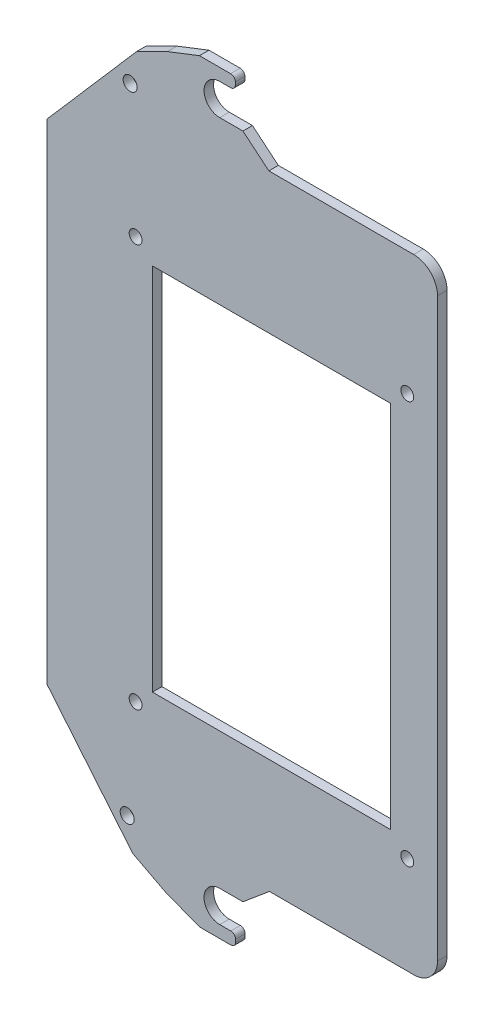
ISO-10303-21;
HEADER;
FILE_DESCRIPTION(('STEP AP214'),'2;1');
FILE_NAME('part.step','',(''),(''),'','','');
FILE_SCHEMA(('AUTOMOTIVE_DESIGN { 1 0 10303 214 1 1 1 1 }'));
ENDSEC;
DATA;
#1=APPLICATION_CONTEXT('core data for automotive mechanical design processes');
#2=APPLICATION_PROTOCOL_DEFINITION('international standard','automotive_design',2000,#1);
#3=PRODUCT_CONTEXT('',#1,'mechanical');
#4=PRODUCT('Part','Part','',(#3));
#5=PRODUCT_RELATED_PRODUCT_CATEGORY('part','',(#4));
#6=PRODUCT_DEFINITION_FORMATION('','',#4);
#7=PRODUCT_DEFINITION_CONTEXT('part definition',#1,'design');
#8=PRODUCT_DEFINITION('design','',#6,#7);
#9=PRODUCT_DEFINITION_SHAPE('','',#8);
#10=(LENGTH_UNIT() NAMED_UNIT(*) SI_UNIT(.MILLI.,.METRE.));
#11=(NAMED_UNIT(*) PLANE_ANGLE_UNIT() SI_UNIT($,.RADIAN.));
#12=(NAMED_UNIT(*) SI_UNIT($,.STERADIAN.) SOLID_ANGLE_UNIT());
#13=UNCERTAINTY_MEASURE_WITH_UNIT(LENGTH_MEASURE(1.E-05),#10,'distance_accuracy_value','');
#14=(GEOMETRIC_REPRESENTATION_CONTEXT(3) GLOBAL_UNCERTAINTY_ASSIGNED_CONTEXT((#13)) GLOBAL_UNIT_ASSIGNED_CONTEXT((#10,
#11,#12)) REPRESENTATION_CONTEXT('',''));
#15=CARTESIAN_POINT('',(0.,0.,0.));
#16=DIRECTION('',(0.,0.,1.));
#17=DIRECTION('',(1.,0.,0.));
#18=AXIS2_PLACEMENT_3D('',#15,#16,#17);
#19=CARTESIAN_POINT('',(10874.1660554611,3506.25153713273,2.032));
#20=DIRECTION('',(0.,0.,1.));
#21=DIRECTION('',(1.,0.,0.));
#22=AXIS2_PLACEMENT_3D('',#19,#20,#21);
#23=CYLINDRICAL_SURFACE('',#22,1.016);
#24=DIRECTION('',(0.,0.,1.));
#25=VECTOR('',#24,1.);
#26=CARTESIAN_POINT('',(10875.1820554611,3506.25153713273,2.032));
#27=LINE('',#26,#25);
#28=CARTESIAN_POINT('',(10875.1820554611,3506.25153713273,0.));
#29=VERTEX_POINT('',#28);
#30=CARTESIAN_POINT('',(10875.1820554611,3506.25153713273,2.032));
#31=VERTEX_POINT('',#30);
#32=EDGE_CURVE('E649',#29,#31,#27,.T.);
#33=ORIENTED_EDGE('',*,*,#32,.F.);
#34=CARTESIAN_POINT('',(10874.1660554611,3506.25153713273,0.));
#35=DIRECTION('',(0.,0.,1.));
#36=DIRECTION('',(1.,0.,0.));
#37=AXIS2_PLACEMENT_3D('',#34,#35,#36);
#38=CIRCLE('',#37,1.016);
#39=CARTESIAN_POINT('',(10874.1660554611,3507.26753713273,0.));
#40=VERTEX_POINT('',#39);
#41=EDGE_CURVE('E62',#40,#29,#38,.F.);
#42=ORIENTED_EDGE('',*,*,#41,.F.);
#43=DIRECTION('',(0.,0.,1.));
#44=VECTOR('',#43,1.);
#45=CARTESIAN_POINT('',(10874.1660554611,3507.26753713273,2.032));
#46=LINE('',#45,#44);
#47=CARTESIAN_POINT('',(10874.1660554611,3507.26753713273,2.032));
#48=VERTEX_POINT('',#47);
#49=EDGE_CURVE('E653',#48,#40,#46,.F.);
#50=ORIENTED_EDGE('',*,*,#49,.F.);
#51=CARTESIAN_POINT('',(10874.1660554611,3506.25153713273,2.032));
#52=DIRECTION('',(0.,0.,1.));
#53=DIRECTION('',(1.,0.,0.));
#54=AXIS2_PLACEMENT_3D('',#51,#52,#53);
#55=CIRCLE('',#54,1.016);
#56=EDGE_CURVE('E13',#31,#48,#55,.T.);
#57=ORIENTED_EDGE('',*,*,#56,.F.);
#58=EDGE_LOOP('',(#33,#42,#50,#57));
#59=FACE_BOUND('',#58,.T.);
#60=ADVANCED_FACE('F54',(#59),#23,.T.);
#61=CARTESIAN_POINT('',(10874.1660554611,3505.68485709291,2.032));
#62=DIRECTION('',(0.,0.,1.));
#63=DIRECTION('',(1.,0.,0.));
#64=AXIS2_PLACEMENT_3D('',#61,#62,#63);
#65=CYLINDRICAL_SURFACE('',#64,1.016);
#66=DIRECTION('',(0.,0.,1.));
#67=VECTOR('',#66,1.);
#68=CARTESIAN_POINT('',(10874.1660554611,3504.66885709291,2.032));
#69=LINE('',#68,#67);
#70=CARTESIAN_POINT('',(10874.1660554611,3504.66885709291,0.));
#71=VERTEX_POINT('',#70);
#72=CARTESIAN_POINT('',(10874.1660554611,3504.66885709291,2.032));
#73=VERTEX_POINT('',#72);
#74=EDGE_CURVE('E635',#71,#73,#69,.T.);
#75=ORIENTED_EDGE('',*,*,#74,.F.);
#76=CARTESIAN_POINT('',(10874.1660554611,3505.68485709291,0.));
#77=DIRECTION('',(0.,0.,1.));
#78=DIRECTION('',(1.,0.,0.));
#79=AXIS2_PLACEMENT_3D('',#76,#77,#78);
#80=CIRCLE('',#79,1.016);
#81=CARTESIAN_POINT('',(10875.1820554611,3505.68485709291,0.));
#82=VERTEX_POINT('',#81);
#83=EDGE_CURVE('E643',#82,#71,#80,.F.);
#84=ORIENTED_EDGE('',*,*,#83,.F.);
#85=DIRECTION('',(0.,0.,1.));
#86=VECTOR('',#85,1.);
#87=CARTESIAN_POINT('',(10875.1820554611,3505.68485709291,2.032));
#88=LINE('',#87,#86);
#89=CARTESIAN_POINT('',(10875.1820554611,3505.68485709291,2.032));
#90=VERTEX_POINT('',#89);
#91=EDGE_CURVE('E639',#90,#82,#88,.F.);
#92=ORIENTED_EDGE('',*,*,#91,.F.);
#93=CARTESIAN_POINT('',(10874.1660554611,3505.68485709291,2.032));
#94=DIRECTION('',(0.,0.,1.));
#95=DIRECTION('',(1.,0.,0.));
#96=AXIS2_PLACEMENT_3D('',#93,#94,#95);
#97=CIRCLE('',#96,1.016);
#98=EDGE_CURVE('E646',#73,#90,#97,.T.);
#99=ORIENTED_EDGE('',*,*,#98,.F.);
#100=EDGE_LOOP('',(#75,#84,#92,#99));
#101=FACE_BOUND('',#100,.T.);
#102=ADVANCED_FACE('F667',(#101),#65,.T.);
#103=CARTESIAN_POINT('',(10874.2239121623,3347.74734528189,2.032));
#104=DIRECTION('',(0.,0.,1.));
#105=DIRECTION('',(1.,0.,0.));
#106=AXIS2_PLACEMENT_3D('',#103,#104,#105);
#107=CYLINDRICAL_SURFACE('',#106,1.016);
#108=DIRECTION('',(0.,0.,1.));
#109=VECTOR('',#108,1.);
#110=CARTESIAN_POINT('',(10875.2399121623,3347.74734528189,2.032));
#111=LINE('',#110,#109);
#112=CARTESIAN_POINT('',(10875.2399121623,3347.74734528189,0.));
#113=VERTEX_POINT('',#112);
#114=CARTESIAN_POINT('',(10875.2399121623,3347.74734528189,2.032));
#115=VERTEX_POINT('',#114);
#116=EDGE_CURVE('E621',#113,#115,#111,.T.);
#117=ORIENTED_EDGE('',*,*,#116,.F.);
#118=CARTESIAN_POINT('',(10874.2239121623,3347.74734528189,0.));
#119=DIRECTION('',(0.,0.,1.));
#120=DIRECTION('',(1.,0.,0.));
#121=AXIS2_PLACEMENT_3D('',#118,#119,#120);
#122=CIRCLE('',#121,1.016);
#123=CARTESIAN_POINT('',(10874.2239121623,3348.76334528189,0.));
#124=VERTEX_POINT('',#123);
#125=EDGE_CURVE('E629',#124,#113,#122,.F.);
#126=ORIENTED_EDGE('',*,*,#125,.F.);
#127=DIRECTION('',(0.,0.,1.));
#128=VECTOR('',#127,1.);
#129=CARTESIAN_POINT('',(10874.2239121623,3348.76334528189,2.032));
#130=LINE('',#129,#128);
#131=CARTESIAN_POINT('',(10874.2239121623,3348.76334528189,2.032));
#132=VERTEX_POINT('',#131);
#133=EDGE_CURVE('E625',#132,#124,#130,.F.);
#134=ORIENTED_EDGE('',*,*,#133,.F.);
#135=CARTESIAN_POINT('',(10874.2239121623,3347.74734528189,2.032));
#136=DIRECTION('',(0.,0.,1.));
#137=DIRECTION('',(1.,0.,0.));
#138=AXIS2_PLACEMENT_3D('',#135,#136,#137);
#139=CIRCLE('',#138,1.016);
#140=EDGE_CURVE('E632',#115,#132,#139,.T.);
#141=ORIENTED_EDGE('',*,*,#140,.F.);
#142=EDGE_LOOP('',(#117,#126,#134,#141));
#143=FACE_BOUND('',#142,.T.);
#144=ADVANCED_FACE('F731',(#143),#107,.T.);
#145=CARTESIAN_POINT('',(10874.2239121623,3347.18092181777,2.032));
#146=DIRECTION('',(0.,0.,-1.));
#147=DIRECTION('',(-1.,0.,0.));
#148=AXIS2_PLACEMENT_3D('',#145,#146,#147);
#149=CYLINDRICAL_SURFACE('',#148,1.016);
#150=DIRECTION('',(0.,0.,-1.));
#151=VECTOR('',#150,1.);
#152=CARTESIAN_POINT('',(10875.2399121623,3347.18092181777,2.032));
#153=LINE('',#152,#151);
#154=CARTESIAN_POINT('',(10875.2399121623,3347.18092181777,2.032));
#155=VERTEX_POINT('',#154);
#156=CARTESIAN_POINT('',(10875.2399121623,3347.18092181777,0.));
#157=VERTEX_POINT('',#156);
#158=EDGE_CURVE('E607',#155,#157,#153,.T.);
#159=ORIENTED_EDGE('',*,*,#158,.F.);
#160=CARTESIAN_POINT('',(10874.2239121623,3347.18092181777,2.032));
#161=DIRECTION('',(0.,0.,1.));
#162=DIRECTION('',(1.,0.,0.));
#163=AXIS2_PLACEMENT_3D('',#160,#161,#162);
#164=CIRCLE('',#163,1.016);
#165=CARTESIAN_POINT('',(10874.2239121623,3346.16492181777,2.032));
#166=VERTEX_POINT('',#165);
#167=EDGE_CURVE('E615',#166,#155,#164,.T.);
#168=ORIENTED_EDGE('',*,*,#167,.F.);
#169=DIRECTION('',(0.,0.,-1.));
#170=VECTOR('',#169,1.);
#171=CARTESIAN_POINT('',(10874.2239121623,3346.16492181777,2.032));
#172=LINE('',#171,#170);
#173=CARTESIAN_POINT('',(10874.2239121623,3346.16492181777,0.));
#174=VERTEX_POINT('',#173);
#175=EDGE_CURVE('E611',#174,#166,#172,.F.);
#176=ORIENTED_EDGE('',*,*,#175,.F.);
#177=CARTESIAN_POINT('',(10874.2239121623,3347.18092181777,0.));
#178=DIRECTION('',(0.,0.,1.));
#179=DIRECTION('',(1.,0.,0.));
#180=AXIS2_PLACEMENT_3D('',#177,#178,#179);
#181=CIRCLE('',#180,1.016);
#182=EDGE_CURVE('E618',#157,#174,#181,.F.);
#183=ORIENTED_EDGE('',*,*,#182,.F.);
#184=EDGE_LOOP('',(#159,#168,#176,#183));
#185=FACE_BOUND('',#184,.T.);
#186=ADVANCED_FACE('F740',(#185),#149,.T.);
#187=CARTESIAN_POINT('',(10913.2602505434,3365.2718064,2.032));
#188=DIRECTION('',(0.,0.,-1.));
#189=DIRECTION('',(-1.,0.,0.));
#190=AXIS2_PLACEMENT_3D('',#187,#188,#189);
#191=CYLINDRICAL_SURFACE('',#190,5.08);
#192=DIRECTION('',(0.,0.,-1.));
#193=VECTOR('',#192,1.);
#194=CARTESIAN_POINT('',(10918.3402505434,3365.2718064,2.032));
#195=LINE('',#194,#193);
#196=CARTESIAN_POINT('',(10918.3402505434,3365.2718064,2.032));
#197=VERTEX_POINT('',#196);
#198=CARTESIAN_POINT('',(10918.3402505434,3365.2718064,0.));
#199=VERTEX_POINT('',#198);
#200=EDGE_CURVE('E593',#197,#199,#195,.T.);
#201=ORIENTED_EDGE('',*,*,#200,.F.);
#202=CARTESIAN_POINT('',(10913.2602505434,3365.2718064,2.032));
#203=DIRECTION('',(0.,0.,1.));
#204=DIRECTION('',(1.,0.,0.));
#205=AXIS2_PLACEMENT_3D('',#202,#203,#204);
#206=CIRCLE('',#205,5.08);
#207=CARTESIAN_POINT('',(10913.2602505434,3360.1918064,2.032));
#208=VERTEX_POINT('',#207);
#209=EDGE_CURVE('E601',#208,#197,#206,.T.);
#210=ORIENTED_EDGE('',*,*,#209,.F.);
#211=DIRECTION('',(0.,0.,-1.));
#212=VECTOR('',#211,1.);
#213=CARTESIAN_POINT('',(10913.2602505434,3360.1918064,2.032));
#214=LINE('',#213,#212);
#215=CARTESIAN_POINT('',(10913.2602505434,3360.1918064,0.));
#216=VERTEX_POINT('',#215);
#217=EDGE_CURVE('E597',#216,#208,#214,.F.);
#218=ORIENTED_EDGE('',*,*,#217,.F.);
#219=CARTESIAN_POINT('',(10913.2602505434,3365.2718064,0.));
#220=DIRECTION('',(0.,0.,1.));
#221=DIRECTION('',(1.,0.,0.));
#222=AXIS2_PLACEMENT_3D('',#219,#220,#221);
#223=CIRCLE('',#222,5.08);
#224=EDGE_CURVE('E604',#199,#216,#223,.F.);
#225=ORIENTED_EDGE('',*,*,#224,.F.);
#226=EDGE_LOOP('',(#201,#210,#218,#225));
#227=FACE_BOUND('',#226,.T.);
#228=ADVANCED_FACE('F703',(#227),#191,.T.);
#229=CARTESIAN_POINT('',(10913.2602505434,3488.2934144,2.032));
#230=DIRECTION('',(0.,0.,-1.));
#231=DIRECTION('',(-1.,0.,0.));
#232=AXIS2_PLACEMENT_3D('',#229,#230,#231);
#233=CYLINDRICAL_SURFACE('',#232,5.08);
#234=DIRECTION('',(0.,0.,-1.));
#235=VECTOR('',#234,1.);
#236=CARTESIAN_POINT('',(10913.2602505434,3493.3734144,2.032));
#237=LINE('',#236,#235);
#238=CARTESIAN_POINT('',(10913.2602505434,3493.3734144,2.032));
#239=VERTEX_POINT('',#238);
#240=CARTESIAN_POINT('',(10913.2602505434,3493.3734144,0.));
#241=VERTEX_POINT('',#240);
#242=EDGE_CURVE('E578',#239,#241,#237,.T.);
#243=ORIENTED_EDGE('',*,*,#242,.F.);
#244=CARTESIAN_POINT('',(10913.2602505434,3488.2934144,2.032));
#245=DIRECTION('',(0.,0.,1.));
#246=DIRECTION('',(1.,0.,0.));
#247=AXIS2_PLACEMENT_3D('',#244,#245,#246);
#248=CIRCLE('',#247,5.08);
#249=CARTESIAN_POINT('',(10918.3402505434,3488.2934144,2.032));
#250=VERTEX_POINT('',#249);
#251=EDGE_CURVE('E586',#250,#239,#248,.T.);
#252=ORIENTED_EDGE('',*,*,#251,.F.);
#253=DIRECTION('',(0.,0.,-1.));
#254=VECTOR('',#253,1.);
#255=CARTESIAN_POINT('',(10918.3402505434,3488.2934144,2.032));
#256=LINE('',#255,#254);
#257=CARTESIAN_POINT('',(10918.3402505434,3488.2934144,0.));
#258=VERTEX_POINT('',#257);
#259=EDGE_CURVE('E582',#258,#250,#256,.F.);
#260=ORIENTED_EDGE('',*,*,#259,.F.);
#261=CARTESIAN_POINT('',(10913.2602505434,3488.2934144,0.));
#262=DIRECTION('',(0.,0.,1.));
#263=DIRECTION('',(1.,0.,0.));
#264=AXIS2_PLACEMENT_3D('',#261,#262,#263);
#265=CIRCLE('',#264,5.08);
#266=EDGE_CURVE('E589',#241,#258,#265,.F.);
#267=ORIENTED_EDGE('',*,*,#266,.F.);
#268=EDGE_LOOP('',(#243,#252,#260,#267));
#269=FACE_BOUND('',#268,.T.);
#270=ADVANCED_FACE('F693',(#269),#233,.T.);
#271=CARTESIAN_POINT('',(10871.8355987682,3352.1098019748,2.032));
#272=DIRECTION('',(0.,0.,1.));
#273=DIRECTION('',(1.,0.,0.));
#274=AXIS2_PLACEMENT_3D('',#271,#272,#273);
#275=PLANE('',#274);
#276=DIRECTION('',(0.,1.,0.));
#277=VECTOR('',#276,1.);
#278=CARTESIAN_POINT('',(10875.1820554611,3504.66885709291,2.032));
#279=LINE('',#278,#277);
#280=EDGE_CURVE('E380',#90,#31,#279,.T.);
#281=ORIENTED_EDGE('',*,*,#280,.T.);
#282=ORIENTED_EDGE('',*,*,#56,.T.);
#283=DIRECTION('',(-1.,0.,0.));
#284=VECTOR('',#283,1.);
#285=CARTESIAN_POINT('',(10875.1820554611,3507.26753713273,2.032));
#286=LINE('',#285,#284);
#287=CARTESIAN_POINT('',(10867.5110434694,3507.26753713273,2.032));
#288=VERTEX_POINT('',#287);
#289=EDGE_CURVE('E383',#48,#288,#286,.T.);
#290=ORIENTED_EDGE('',*,*,#289,.T.);
#291=DIRECTION('',(-0.931894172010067,-0.362730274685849,0.));
#292=VECTOR('',#291,1.);
#293=CARTESIAN_POINT('',(10860.6675284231,3504.60376889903,2.032));
#294=LINE('',#293,#292);
#295=CARTESIAN_POINT('',(10860.6675284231,3504.60376889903,2.032));
#296=VERTEX_POINT('',#295);
#297=EDGE_CURVE('E386',#288,#296,#294,.T.);
#298=ORIENTED_EDGE('',*,*,#297,.T.);
#299=DIRECTION('',(-0.895259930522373,-0.445544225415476,0.));
#300=VECTOR('',#299,1.);
#301=CARTESIAN_POINT('',(10854.1150434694,3501.34279213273,2.032));
#302=LINE('',#301,#300);
#303=CARTESIAN_POINT('',(10854.1150434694,3501.34279213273,2.032));
#304=VERTEX_POINT('',#303);
#305=EDGE_CURVE('E389',#296,#304,#302,.T.);
#306=ORIENTED_EDGE('',*,*,#305,.T.);
#307=DIRECTION('',(-0.777468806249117,-0.628921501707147,0.));
#308=VECTOR('',#307,1.);
#309=CARTESIAN_POINT('',(10854.1004934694,3501.33102213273,2.032));
#310=LINE('',#309,#308);
#311=CARTESIAN_POINT('',(10854.1004934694,3501.33102213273,2.032));
#312=VERTEX_POINT('',#311);
#313=EDGE_CURVE('E392',#304,#312,#310,.T.);
#314=ORIENTED_EDGE('',*,*,#313,.T.);
#315=DIRECTION('',(-0.65538942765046,-0.755291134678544,0.));
#316=VECTOR('',#315,1.);
#317=CARTESIAN_POINT('',(10854.1004934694,3501.33102213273,2.032));
#318=LINE('',#317,#316);
#319=CARTESIAN_POINT('',(10834.9529554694,3479.2648045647,2.032));
#320=VERTEX_POINT('',#319);
#321=EDGE_CURVE('E395',#312,#320,#318,.T.);
#322=ORIENTED_EDGE('',*,*,#321,.T.);
#323=DIRECTION('',(0.,-1.,0.));
#324=VECTOR('',#323,1.);
#325=CARTESIAN_POINT('',(10834.9529554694,3479.2648045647,2.032));
#326=LINE('',#325,#324);
#327=CARTESIAN_POINT('',(10834.9529554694,3374.75768053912,2.032));
#328=VERTEX_POINT('',#327);
#329=EDGE_CURVE('E398',#320,#328,#326,.T.);
#330=ORIENTED_EDGE('',*,*,#329,.T.);
#331=DIRECTION('',(0.637647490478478,-0.770328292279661,0.));
#332=VECTOR('',#331,1.);
#333=CARTESIAN_POINT('',(10834.9529554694,3374.75768053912,2.032));
#334=LINE('',#333,#332);
#335=CARTESIAN_POINT('',(10853.2782434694,3352.61929213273,2.032));
#336=VERTEX_POINT('',#335);
#337=EDGE_CURVE('E401',#328,#336,#334,.T.);
#338=ORIENTED_EDGE('',*,*,#337,.T.);
#339=DIRECTION('',(0.886464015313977,-0.462797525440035,0.));
#340=VECTOR('',#339,1.);
#341=CARTESIAN_POINT('',(10860.222293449,3348.99400211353,2.032));
#342=LINE('',#341,#340);
#343=CARTESIAN_POINT('',(10860.222293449,3348.99400211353,2.032));
#344=VERTEX_POINT('',#343);
#345=EDGE_CURVE('E404',#336,#344,#342,.T.);
#346=ORIENTED_EDGE('',*,*,#345,.T.);
#347=DIRECTION('',(0.932239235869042,-0.361842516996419,0.));
#348=VECTOR('',#347,1.);
#349=CARTESIAN_POINT('',(10867.5110434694,3346.16492181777,2.032));
#350=LINE('',#349,#348);
#351=CARTESIAN_POINT('',(10867.5110434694,3346.16492181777,2.032));
#352=VERTEX_POINT('',#351);
#353=EDGE_CURVE('E407',#344,#352,#350,.T.);
#354=ORIENTED_EDGE('',*,*,#353,.T.);
#355=DIRECTION('',(1.,0.,0.));
#356=VECTOR('',#355,1.);
#357=CARTESIAN_POINT('',(10875.2399121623,3346.16492181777,2.032));
#358=LINE('',#357,#356);
#359=EDGE_CURVE('E410',#352,#166,#358,.T.);
#360=ORIENTED_EDGE('',*,*,#359,.T.);
#361=ORIENTED_EDGE('',*,*,#167,.T.);
#362=DIRECTION('',(0.,1.,0.));
#363=VECTOR('',#362,1.);
#364=CARTESIAN_POINT('',(10875.2399121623,3348.76334528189,2.032));
#365=LINE('',#364,#363);
#366=EDGE_CURVE('E414',#155,#115,#365,.T.);
#367=ORIENTED_EDGE('',*,*,#366,.T.);
#368=ORIENTED_EDGE('',*,*,#140,.T.);
#369=DIRECTION('',(-1.,1.30448979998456E-13,0.));
#370=VECTOR('',#369,1.);
#371=CARTESIAN_POINT('',(10871.8355987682,3348.76334528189,2.032));
#372=LINE('',#371,#370);
#373=CARTESIAN_POINT('',(10871.8355987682,3348.76334528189,2.032));
#374=VERTEX_POINT('',#373);
#375=EDGE_CURVE('E418',#132,#374,#372,.T.);
#376=ORIENTED_EDGE('',*,*,#375,.T.);
#377=CARTESIAN_POINT('',(10871.8355987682,3352.1098019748,2.032));
#378=DIRECTION('',(0.,0.,-1.));
#379=DIRECTION('',(1.,0.,0.));
#380=AXIS2_PLACEMENT_3D('',#377,#378,#379);
#381=CIRCLE('',#380,3.34645669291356);
#382=CARTESIAN_POINT('',(10871.8355987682,3355.45625866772,2.032));
#383=VERTEX_POINT('',#382);
#384=EDGE_CURVE('E421',#374,#383,#381,.T.);
#385=ORIENTED_EDGE('',*,*,#384,.T.);
#386=DIRECTION('',(0.99999965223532,0.000833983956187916,0.));
#387=VECTOR('',#386,1.);
#388=CARTESIAN_POINT('',(10871.8355987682,3355.45625866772,2.032));
#389=LINE('',#388,#387);
#390=CARTESIAN_POINT('',(10876.7976307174,3355.46039692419,2.032));
#391=VERTEX_POINT('',#390);
#392=EDGE_CURVE('E424',#383,#391,#389,.T.);
#393=ORIENTED_EDGE('',*,*,#392,.T.);
#394=DIRECTION('',(0.767146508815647,0.641471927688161,0.));
#395=VECTOR('',#394,1.);
#396=CARTESIAN_POINT('',(10876.7976307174,3355.46039692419,2.032));
#397=LINE('',#396,#395);
#398=CARTESIAN_POINT('',(10882.4559987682,3360.1918064,2.032));
#399=VERTEX_POINT('',#398);
#400=EDGE_CURVE('E427',#391,#399,#397,.T.);
#401=ORIENTED_EDGE('',*,*,#400,.T.);
#402=DIRECTION('',(1.,0.,0.));
#403=VECTOR('',#402,1.);
#404=CARTESIAN_POINT('',(10882.4559987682,3360.1918064,2.032));
#405=LINE('',#404,#403);
#406=EDGE_CURVE('E430',#399,#208,#405,.T.);
#407=ORIENTED_EDGE('',*,*,#406,.T.);
#408=ORIENTED_EDGE('',*,*,#209,.T.);
#409=DIRECTION('',(0.,1.,0.));
#410=VECTOR('',#409,1.);
#411=CARTESIAN_POINT('',(10918.3402505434,3495.753514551,2.032));
#412=LINE('',#411,#410);
#413=EDGE_CURVE('E294',#197,#250,#412,.T.);
#414=ORIENTED_EDGE('',*,*,#413,.T.);
#415=ORIENTED_EDGE('',*,*,#251,.T.);
#416=DIRECTION('',(-1.,0.,0.));
#417=VECTOR('',#416,1.);
#418=CARTESIAN_POINT('',(10882.3239867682,3493.3734144,2.032));
#419=LINE('',#418,#417);
#420=CARTESIAN_POINT('',(10882.3239867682,3493.3734144,2.032));
#421=VERTEX_POINT('',#420);
#422=EDGE_CURVE('E434',#239,#421,#419,.T.);
#423=ORIENTED_EDGE('',*,*,#422,.T.);
#424=DIRECTION('',(-0.768410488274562,0.6399572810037,0.));
#425=VECTOR('',#424,1.);
#426=CARTESIAN_POINT('',(10876.7976307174,3497.97594370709,2.032));
#427=LINE('',#426,#425);
#428=CARTESIAN_POINT('',(10876.7976307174,3497.97594370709,2.032));
#429=VERTEX_POINT('',#428);
#430=EDGE_CURVE('E437',#421,#429,#427,.T.);
#431=ORIENTED_EDGE('',*,*,#430,.T.);
#432=DIRECTION('',(-1.,0.,0.));
#433=VECTOR('',#432,1.);
#434=CARTESIAN_POINT('',(10871.8355987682,3497.97594370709,2.032));
#435=LINE('',#434,#433);
#436=CARTESIAN_POINT('',(10871.8355987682,3497.97594370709,2.032));
#437=VERTEX_POINT('',#436);
#438=EDGE_CURVE('E368',#429,#437,#435,.T.);
#439=ORIENTED_EDGE('',*,*,#438,.T.);
#440=CARTESIAN_POINT('',(10871.8355987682,3501.3224004,2.032));
#441=DIRECTION('',(0.,0.,-1.));
#442=DIRECTION('',(1.,0.,0.));
#443=AXIS2_PLACEMENT_3D('',#440,#441,#442);
#444=CIRCLE('',#443,3.34645669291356);
#445=CARTESIAN_POINT('',(10871.8355987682,3504.66885709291,2.032));
#446=VERTEX_POINT('',#445);
#447=EDGE_CURVE('E372',#437,#446,#444,.T.);
#448=ORIENTED_EDGE('',*,*,#447,.T.);
#449=DIRECTION('',(1.,0.,0.));
#450=VECTOR('',#449,1.);
#451=CARTESIAN_POINT('',(10871.8355987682,3504.66885709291,2.032));
#452=LINE('',#451,#450);
#453=EDGE_CURVE('E376',#446,#73,#452,.T.);
#454=ORIENTED_EDGE('',*,*,#453,.T.);
#455=ORIENTED_EDGE('',*,*,#98,.T.);
#456=EDGE_LOOP('',(#281,#282,#290,#298,#306,#314,#322,#330,#338,#346,#354,#360,#361,#367,#368,
#376,#385,#393,#401,#407,#408,#414,#415,#423,#431,#439,#448,#454,#455));
#457=FACE_BOUND('',#456,.T.);
#458=CARTESIAN_POINT('',(10853.8852504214,3380.9702923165,2.032));
#459=DIRECTION('',(0.,0.,-1.));
#460=DIRECTION('',(-1.,0.,0.));
#461=AXIS2_PLACEMENT_3D('',#458,#459,#460);
#462=CIRCLE('',#461,1.37500004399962);
#463=CARTESIAN_POINT('',(10852.5102503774,3380.9702923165,2.032));
#464=VERTEX_POINT('',#463);
#465=EDGE_CURVE('E322',#464,#464,#462,.T.);
#466=ORIENTED_EDGE('',*,*,#465,.T.);
#467=EDGE_LOOP('',(#466));
#468=FACE_BOUND('',#467,.T.);
#469=CARTESIAN_POINT('',(10911.8852504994,3380.9702923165,2.032));
#470=DIRECTION('',(0.,0.,-1.));
#471=DIRECTION('',(-1.,0.,0.));
#472=AXIS2_PLACEMENT_3D('',#469,#470,#471);
#473=CIRCLE('',#472,1.37500004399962);
#474=CARTESIAN_POINT('',(10910.5102504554,3380.9702923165,2.032));
#475=VERTEX_POINT('',#474);
#476=EDGE_CURVE('E321',#475,#475,#473,.T.);
#477=ORIENTED_EDGE('',*,*,#476,.T.);
#478=EDGE_LOOP('',(#477));
#479=FACE_BOUND('',#478,.T.);
#480=CARTESIAN_POINT('',(10911.8852504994,3466.9702922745,2.032));
#481=DIRECTION('',(0.,0.,-1.));
#482=DIRECTION('',(-1.,0.,0.));
#483=AXIS2_PLACEMENT_3D('',#480,#481,#482);
#484=CIRCLE('',#483,1.37500004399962);
#485=CARTESIAN_POINT('',(10910.5102504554,3466.9702922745,2.032));
#486=VERTEX_POINT('',#485);
#487=EDGE_CURVE('E333',#486,#486,#484,.T.);
#488=ORIENTED_EDGE('',*,*,#487,.T.);
#489=EDGE_LOOP('',(#488));
#490=FACE_BOUND('',#489,.T.);
#491=DIRECTION('',(0.,-1.,0.));
#492=VECTOR('',#491,1.);
#493=CARTESIAN_POINT('',(10908.2931480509,3463.37818982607,2.032));
#494=LINE('',#493,#492);
#495=CARTESIAN_POINT('',(10908.2931480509,3463.37818982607,2.032));
#496=VERTEX_POINT('',#495);
#497=CARTESIAN_POINT('',(10908.2931480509,3384.56239476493,2.032));
#498=VERTEX_POINT('',#497);
#499=EDGE_CURVE('E272',#496,#498,#494,.T.);
#500=ORIENTED_EDGE('',*,*,#499,.T.);
#501=DIRECTION('',(-1.,0.,0.));
#502=VECTOR('',#501,1.);
#503=CARTESIAN_POINT('',(10908.2931480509,3384.56239476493,2.032));
#504=LINE('',#503,#502);
#505=CARTESIAN_POINT('',(10857.4773528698,3384.56239476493,2.032));
#506=VERTEX_POINT('',#505);
#507=EDGE_CURVE('E311',#498,#506,#504,.T.);
#508=ORIENTED_EDGE('',*,*,#507,.T.);
#509=DIRECTION('',(0.,1.,0.));
#510=VECTOR('',#509,1.);
#511=CARTESIAN_POINT('',(10857.4773528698,3463.37818982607,2.032));
#512=LINE('',#511,#510);
#513=CARTESIAN_POINT('',(10857.4773528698,3463.37818982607,2.032));
#514=VERTEX_POINT('',#513);
#515=EDGE_CURVE('E306',#506,#514,#512,.T.);
#516=ORIENTED_EDGE('',*,*,#515,.T.);
#517=DIRECTION('',(1.,0.,0.));
#518=VECTOR('',#517,1.);
#519=CARTESIAN_POINT('',(10908.2931480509,3463.37818982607,2.032));
#520=LINE('',#519,#518);
#521=EDGE_CURVE('E303',#514,#496,#520,.T.);
#522=ORIENTED_EDGE('',*,*,#521,.T.);
#523=EDGE_LOOP('',(#500,#508,#516,#522));
#524=FACE_BOUND('',#523,.T.);
#525=CARTESIAN_POINT('',(10853.8852504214,3466.9702922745,2.032));
#526=DIRECTION('',(0.,0.,-1.));
#527=DIRECTION('',(-1.,0.,0.));
#528=AXIS2_PLACEMENT_3D('',#525,#526,#527);
#529=CIRCLE('',#528,1.37500004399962);
#530=CARTESIAN_POINT('',(10852.5102503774,3466.9702922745,2.032));
#531=VERTEX_POINT('',#530);
#532=EDGE_CURVE('E344',#531,#531,#529,.T.);
#533=ORIENTED_EDGE('',*,*,#532,.T.);
#534=EDGE_LOOP('',(#533));
#535=FACE_BOUND('',#534,.T.);
#536=CARTESIAN_POINT('',(10852.7113527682,3494.7484304,2.032));
#537=DIRECTION('',(0.,0.,1.));
#538=DIRECTION('',(1.,0.,0.));
#539=AXIS2_PLACEMENT_3D('',#536,#537,#538);
#540=CIRCLE('',#539,1.50000000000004);
#541=CARTESIAN_POINT('',(10854.2113527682,3494.7484304,2.032));
#542=VERTEX_POINT('',#541);
#543=EDGE_CURVE('E360',#542,#542,#540,.T.);
#544=ORIENTED_EDGE('',*,*,#543,.F.);
#545=EDGE_LOOP('',(#544));
#546=FACE_BOUND('',#545,.T.);
#547=CARTESIAN_POINT('',(10852.0820247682,3359.0401704,2.032));
#548=DIRECTION('',(0.,0.,1.));
#549=DIRECTION('',(1.,0.,0.));
#550=AXIS2_PLACEMENT_3D('',#547,#548,#549);
#551=CIRCLE('',#550,1.50000000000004);
#552=CARTESIAN_POINT('',(10853.5820247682,3359.0401704,2.032));
#553=VERTEX_POINT('',#552);
#554=EDGE_CURVE('E352',#553,#553,#551,.T.);
#555=ORIENTED_EDGE('',*,*,#554,.F.);
#556=EDGE_LOOP('',(#555));
#557=FACE_BOUND('',#556,.T.);
#558=ADVANCED_FACE('F786',(#457,#468,#479,#490,#524,#535,#546,#557),#275,.T.);
#559=CARTESIAN_POINT('',(10871.8355987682,3352.1098019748,0.));
#560=DIRECTION('',(0.,0.,1.));
#561=DIRECTION('',(1.,0.,0.));
#562=AXIS2_PLACEMENT_3D('',#559,#560,#561);
#563=PLANE('',#562);
#564=CARTESIAN_POINT('',(10853.8852504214,3380.9702923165,0.));
#565=DIRECTION('',(0.,0.,-1.));
#566=DIRECTION('',(-1.,0.,0.));
#567=AXIS2_PLACEMENT_3D('',#564,#565,#566);
#568=CIRCLE('',#567,1.37500004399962);
#569=CARTESIAN_POINT('',(10852.5102503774,3380.9702923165,0.));
#570=VERTEX_POINT('',#569);
#571=EDGE_CURVE('E317',#570,#570,#568,.T.);
#572=ORIENTED_EDGE('',*,*,#571,.F.);
#573=EDGE_LOOP('',(#572));
#574=FACE_BOUND('',#573,.T.);
#575=CARTESIAN_POINT('',(10911.8852504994,3380.9702923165,0.));
#576=DIRECTION('',(0.,0.,-1.));
#577=DIRECTION('',(-1.,0.,0.));
#578=AXIS2_PLACEMENT_3D('',#575,#576,#577);
#579=CIRCLE('',#578,1.37500004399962);
#580=CARTESIAN_POINT('',(10910.5102504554,3380.9702923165,0.));
#581=VERTEX_POINT('',#580);
#582=EDGE_CURVE('E337',#581,#581,#579,.T.);
#583=ORIENTED_EDGE('',*,*,#582,.F.);
#584=EDGE_LOOP('',(#583));
#585=FACE_BOUND('',#584,.T.);
#586=CARTESIAN_POINT('',(10911.8852504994,3466.9702922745,0.));
#587=DIRECTION('',(0.,0.,-1.));
#588=DIRECTION('',(-1.,0.,0.));
#589=AXIS2_PLACEMENT_3D('',#586,#587,#588);
#590=CIRCLE('',#589,1.37500004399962);
#591=CARTESIAN_POINT('',(10910.5102504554,3466.9702922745,0.));
#592=VERTEX_POINT('',#591);
#593=EDGE_CURVE('E328',#592,#592,#590,.T.);
#594=ORIENTED_EDGE('',*,*,#593,.F.);
#595=EDGE_LOOP('',(#594));
#596=FACE_BOUND('',#595,.T.);
#597=DIRECTION('',(-1.,0.,0.));
#598=VECTOR('',#597,1.);
#599=CARTESIAN_POINT('',(10908.2931480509,3384.56239476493,0.));
#600=LINE('',#599,#598);
#601=CARTESIAN_POINT('',(10908.2931480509,3384.56239476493,0.));
#602=VERTEX_POINT('',#601);
#603=CARTESIAN_POINT('',(10857.4773528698,3384.56239476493,0.));
#604=VERTEX_POINT('',#603);
#605=EDGE_CURVE('E292',#602,#604,#600,.T.);
#606=ORIENTED_EDGE('',*,*,#605,.F.);
#607=DIRECTION('',(0.,-1.,0.));
#608=VECTOR('',#607,1.);
#609=CARTESIAN_POINT('',(10908.2931480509,3463.37818982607,0.));
#610=LINE('',#609,#608);
#611=CARTESIAN_POINT('',(10908.2931480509,3463.37818982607,0.));
#612=VERTEX_POINT('',#611);
#613=EDGE_CURVE('E269',#612,#602,#610,.T.);
#614=ORIENTED_EDGE('',*,*,#613,.F.);
#615=DIRECTION('',(1.,0.,0.));
#616=VECTOR('',#615,1.);
#617=CARTESIAN_POINT('',(10908.2931480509,3463.37818982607,0.));
#618=LINE('',#617,#616);
#619=CARTESIAN_POINT('',(10857.4773528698,3463.37818982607,0.));
#620=VERTEX_POINT('',#619);
#621=EDGE_CURVE('E280',#620,#612,#618,.T.);
#622=ORIENTED_EDGE('',*,*,#621,.F.);
#623=DIRECTION('',(0.,1.,0.));
#624=VECTOR('',#623,1.);
#625=CARTESIAN_POINT('',(10857.4773528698,3463.37818982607,0.));
#626=LINE('',#625,#624);
#627=EDGE_CURVE('E286',#604,#620,#626,.T.);
#628=ORIENTED_EDGE('',*,*,#627,.F.);
#629=EDGE_LOOP('',(#606,#614,#622,#628));
#630=FACE_BOUND('',#629,.T.);
#631=CARTESIAN_POINT('',(10853.8852504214,3466.9702922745,0.));
#632=DIRECTION('',(0.,0.,-1.));
#633=DIRECTION('',(-1.,0.,0.));
#634=AXIS2_PLACEMENT_3D('',#631,#632,#633);
#635=CIRCLE('',#634,1.37500004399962);
#636=CARTESIAN_POINT('',(10852.5102503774,3466.9702922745,0.));
#637=VERTEX_POINT('',#636);
#638=EDGE_CURVE('E332',#637,#637,#635,.T.);
#639=ORIENTED_EDGE('',*,*,#638,.F.);
#640=EDGE_LOOP('',(#639));
#641=FACE_BOUND('',#640,.T.);
#642=DIRECTION('',(-1.,0.,0.));
#643=VECTOR('',#642,1.);
#644=CARTESIAN_POINT('',(10875.045942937,3507.26753713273,0.));
#645=LINE('',#644,#643);
#646=CARTESIAN_POINT('',(10867.5110434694,3507.26753713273,0.));
#647=VERTEX_POINT('',#646);
#648=EDGE_CURVE('E455',#40,#647,#645,.T.);
#649=ORIENTED_EDGE('',*,*,#648,.F.);
#650=ORIENTED_EDGE('',*,*,#41,.T.);
#651=DIRECTION('',(0.,1.,0.));
#652=VECTOR('',#651,1.);
#653=CARTESIAN_POINT('',(10875.1820554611,3504.66885709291,0.));
#654=LINE('',#653,#652);
#655=EDGE_CURVE('E451',#82,#29,#654,.T.);
#656=ORIENTED_EDGE('',*,*,#655,.F.);
#657=ORIENTED_EDGE('',*,*,#83,.T.);
#658=DIRECTION('',(1.,0.,0.));
#659=VECTOR('',#658,1.);
#660=CARTESIAN_POINT('',(10871.8355987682,3504.66885709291,0.));
#661=LINE('',#660,#659);
#662=CARTESIAN_POINT('',(10871.8355987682,3504.66885709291,0.));
#663=VERTEX_POINT('',#662);
#664=EDGE_CURVE('E447',#663,#71,#661,.T.);
#665=ORIENTED_EDGE('',*,*,#664,.F.);
#666=CARTESIAN_POINT('',(10871.8355987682,3501.3224004,0.));
#667=DIRECTION('',(0.,0.,-1.));
#668=DIRECTION('',(1.,0.,0.));
#669=AXIS2_PLACEMENT_3D('',#666,#667,#668);
#670=CIRCLE('',#669,3.34645669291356);
#671=CARTESIAN_POINT('',(10871.8355987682,3497.97594370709,0.));
#672=VERTEX_POINT('',#671);
#673=EDGE_CURVE('E444',#672,#663,#670,.T.);
#674=ORIENTED_EDGE('',*,*,#673,.F.);
#675=DIRECTION('',(-1.,0.,0.));
#676=VECTOR('',#675,1.);
#677=CARTESIAN_POINT('',(10871.8355987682,3497.97594370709,0.));
#678=LINE('',#677,#676);
#679=CARTESIAN_POINT('',(10876.7976307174,3497.97594370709,0.));
#680=VERTEX_POINT('',#679);
#681=EDGE_CURVE('E364',#680,#672,#678,.T.);
#682=ORIENTED_EDGE('',*,*,#681,.F.);
#683=DIRECTION('',(-0.768410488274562,0.6399572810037,0.));
#684=VECTOR('',#683,1.);
#685=CARTESIAN_POINT('',(10876.7976307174,3497.97594370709,0.));
#686=LINE('',#685,#684);
#687=CARTESIAN_POINT('',(10882.3239867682,3493.3734144,0.));
#688=VERTEX_POINT('',#687);
#689=EDGE_CURVE('E373',#688,#680,#686,.T.);
#690=ORIENTED_EDGE('',*,*,#689,.F.);
#691=DIRECTION('',(-1.,0.,0.));
#692=VECTOR('',#691,1.);
#693=CARTESIAN_POINT('',(10882.3239867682,3493.3734144,0.));
#694=LINE('',#693,#692);
#695=EDGE_CURVE('E506',#241,#688,#694,.T.);
#696=ORIENTED_EDGE('',*,*,#695,.F.);
#697=ORIENTED_EDGE('',*,*,#266,.T.);
#698=DIRECTION('',(0.,1.,0.));
#699=VECTOR('',#698,1.);
#700=CARTESIAN_POINT('',(10918.3402505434,3495.753514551,0.));
#701=LINE('',#700,#699);
#702=EDGE_CURVE('E298',#199,#258,#701,.T.);
#703=ORIENTED_EDGE('',*,*,#702,.F.);
#704=ORIENTED_EDGE('',*,*,#224,.T.);
#705=DIRECTION('',(1.,0.,0.));
#706=VECTOR('',#705,1.);
#707=CARTESIAN_POINT('',(10882.4559987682,3360.1918064,0.));
#708=LINE('',#707,#706);
#709=CARTESIAN_POINT('',(10882.4559987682,3360.1918064,0.));
#710=VERTEX_POINT('',#709);
#711=EDGE_CURVE('E502',#710,#216,#708,.T.);
#712=ORIENTED_EDGE('',*,*,#711,.F.);
#713=DIRECTION('',(0.767146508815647,0.641471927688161,0.));
#714=VECTOR('',#713,1.);
#715=CARTESIAN_POINT('',(10876.7976307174,3355.46039692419,0.));
#716=LINE('',#715,#714);
#717=CARTESIAN_POINT('',(10876.7976307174,3355.46039692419,0.));
#718=VERTEX_POINT('',#717);
#719=EDGE_CURVE('E499',#718,#710,#716,.T.);
#720=ORIENTED_EDGE('',*,*,#719,.F.);
#721=DIRECTION('',(0.99999965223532,0.000833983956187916,0.));
#722=VECTOR('',#721,1.);
#723=CARTESIAN_POINT('',(10871.8355987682,3355.45625866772,0.));
#724=LINE('',#723,#722);
#725=CARTESIAN_POINT('',(10871.8355987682,3355.45625866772,0.));
#726=VERTEX_POINT('',#725);
#727=EDGE_CURVE('E496',#726,#718,#724,.T.);
#728=ORIENTED_EDGE('',*,*,#727,.F.);
#729=CARTESIAN_POINT('',(10871.8355987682,3352.1098019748,0.));
#730=DIRECTION('',(0.,0.,-1.));
#731=DIRECTION('',(1.,0.,0.));
#732=AXIS2_PLACEMENT_3D('',#729,#730,#731);
#733=CIRCLE('',#732,3.34645669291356);
#734=CARTESIAN_POINT('',(10871.8355987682,3348.76334528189,0.));
#735=VERTEX_POINT('',#734);
#736=EDGE_CURVE('E493',#735,#726,#733,.T.);
#737=ORIENTED_EDGE('',*,*,#736,.F.);
#738=DIRECTION('',(-1.,1.30448979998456E-13,0.));
#739=VECTOR('',#738,1.);
#740=CARTESIAN_POINT('',(10871.8355987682,3348.76334528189,0.));
#741=LINE('',#740,#739);
#742=EDGE_CURVE('E490',#124,#735,#741,.T.);
#743=ORIENTED_EDGE('',*,*,#742,.F.);
#744=ORIENTED_EDGE('',*,*,#125,.T.);
#745=DIRECTION('',(0.,1.,0.));
#746=VECTOR('',#745,1.);
#747=CARTESIAN_POINT('',(10875.2399121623,3348.76334528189,0.));
#748=LINE('',#747,#746);
#749=EDGE_CURVE('E486',#157,#113,#748,.T.);
#750=ORIENTED_EDGE('',*,*,#749,.F.);
#751=ORIENTED_EDGE('',*,*,#182,.T.);
#752=DIRECTION('',(1.,0.,0.));
#753=VECTOR('',#752,1.);
#754=CARTESIAN_POINT('',(10875.2399121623,3346.16492181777,0.));
#755=LINE('',#754,#753);
#756=CARTESIAN_POINT('',(10867.5110434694,3346.16492181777,0.));
#757=VERTEX_POINT('',#756);
#758=EDGE_CURVE('E482',#757,#174,#755,.T.);
#759=ORIENTED_EDGE('',*,*,#758,.F.);
#760=DIRECTION('',(0.932239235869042,-0.361842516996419,0.));
#761=VECTOR('',#760,1.);
#762=CARTESIAN_POINT('',(10867.5110434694,3346.16492181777,0.));
#763=LINE('',#762,#761);
#764=CARTESIAN_POINT('',(10860.222293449,3348.99400211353,0.));
#765=VERTEX_POINT('',#764);
#766=EDGE_CURVE('E479',#765,#757,#763,.T.);
#767=ORIENTED_EDGE('',*,*,#766,.F.);
#768=DIRECTION('',(0.886464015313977,-0.462797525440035,0.));
#769=VECTOR('',#768,1.);
#770=CARTESIAN_POINT('',(10860.222293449,3348.99400211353,0.));
#771=LINE('',#770,#769);
#772=CARTESIAN_POINT('',(10853.2782434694,3352.61929213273,0.));
#773=VERTEX_POINT('',#772);
#774=EDGE_CURVE('E476',#773,#765,#771,.T.);
#775=ORIENTED_EDGE('',*,*,#774,.F.);
#776=DIRECTION('',(0.637647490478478,-0.770328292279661,0.));
#777=VECTOR('',#776,1.);
#778=CARTESIAN_POINT('',(10834.9529554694,3374.75768053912,0.));
#779=LINE('',#778,#777);
#780=CARTESIAN_POINT('',(10834.9529554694,3374.75768053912,0.));
#781=VERTEX_POINT('',#780);
#782=EDGE_CURVE('E473',#781,#773,#779,.T.);
#783=ORIENTED_EDGE('',*,*,#782,.F.);
#784=DIRECTION('',(0.,-1.,0.));
#785=VECTOR('',#784,1.);
#786=CARTESIAN_POINT('',(10834.9529554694,3479.2648045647,0.));
#787=LINE('',#786,#785);
#788=CARTESIAN_POINT('',(10834.9529554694,3479.2648045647,0.));
#789=VERTEX_POINT('',#788);
#790=EDGE_CURVE('E470',#789,#781,#787,.T.);
#791=ORIENTED_EDGE('',*,*,#790,.F.);
#792=DIRECTION('',(-0.65538942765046,-0.755291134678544,0.));
#793=VECTOR('',#792,1.);
#794=CARTESIAN_POINT('',(10854.1004934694,3501.33102213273,0.));
#795=LINE('',#794,#793);
#796=CARTESIAN_POINT('',(10854.1004934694,3501.33102213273,0.));
#797=VERTEX_POINT('',#796);
#798=EDGE_CURVE('E467',#797,#789,#795,.T.);
#799=ORIENTED_EDGE('',*,*,#798,.F.);
#800=DIRECTION('',(-0.777468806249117,-0.628921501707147,0.));
#801=VECTOR('',#800,1.);
#802=CARTESIAN_POINT('',(10854.1004934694,3501.33102213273,0.));
#803=LINE('',#802,#801);
#804=CARTESIAN_POINT('',(10854.1150434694,3501.34279213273,0.));
#805=VERTEX_POINT('',#804);
#806=EDGE_CURVE('E464',#805,#797,#803,.T.);
#807=ORIENTED_EDGE('',*,*,#806,.F.);
#808=DIRECTION('',(-0.895259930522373,-0.445544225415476,0.));
#809=VECTOR('',#808,1.);
#810=CARTESIAN_POINT('',(10854.1150434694,3501.34279213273,0.));
#811=LINE('',#810,#809);
#812=CARTESIAN_POINT('',(10860.6675284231,3504.60376889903,0.));
#813=VERTEX_POINT('',#812);
#814=EDGE_CURVE('E461',#813,#805,#811,.T.);
#815=ORIENTED_EDGE('',*,*,#814,.F.);
#816=DIRECTION('',(-0.931894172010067,-0.362730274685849,0.));
#817=VECTOR('',#816,1.);
#818=CARTESIAN_POINT('',(10860.6675284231,3504.60376889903,0.));
#819=LINE('',#818,#817);
#820=EDGE_CURVE('E458',#647,#813,#819,.T.);
#821=ORIENTED_EDGE('',*,*,#820,.F.);
#822=EDGE_LOOP('',(#649,#650,#656,#657,#665,#674,#682,#690,#696,#697,#703,#704,#712,#720,#728,
#737,#743,#744,#750,#751,#759,#767,#775,#783,#791,#799,#807,#815,#821));
#823=FACE_BOUND('',#822,.T.);
#824=CARTESIAN_POINT('',(10852.7113527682,3494.7484304,0.));
#825=DIRECTION('',(0.,0.,1.));
#826=DIRECTION('',(1.,0.,0.));
#827=AXIS2_PLACEMENT_3D('',#824,#825,#826);
#828=CIRCLE('',#827,1.50000000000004);
#829=CARTESIAN_POINT('',(10854.2113527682,3494.7484304,0.));
#830=VERTEX_POINT('',#829);
#831=EDGE_CURVE('E356',#830,#830,#828,.T.);
#832=ORIENTED_EDGE('',*,*,#831,.T.);
#833=EDGE_LOOP('',(#832));
#834=FACE_BOUND('',#833,.T.);
#835=CARTESIAN_POINT('',(10852.0820247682,3359.0401704,0.));
#836=DIRECTION('',(0.,0.,1.));
#837=DIRECTION('',(1.,0.,0.));
#838=AXIS2_PLACEMENT_3D('',#835,#836,#837);
#839=CIRCLE('',#838,1.50000000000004);
#840=CARTESIAN_POINT('',(10853.5820247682,3359.0401704,0.));
#841=VERTEX_POINT('',#840);
#842=EDGE_CURVE('E348',#841,#841,#839,.T.);
#843=ORIENTED_EDGE('',*,*,#842,.T.);
#844=EDGE_LOOP('',(#843));
#845=FACE_BOUND('',#844,.T.);
#846=ADVANCED_FACE('F289',(#574,#585,#596,#630,#641,#823,#834,#845),#563,.F.);
#847=CARTESIAN_POINT('',(10871.8355987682,3497.97594370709,2.032));
#848=DIRECTION('',(0.,-1.,0.));
#849=DIRECTION('',(0.,0.,-1.));
#850=AXIS2_PLACEMENT_3D('',#847,#848,#849);
#851=PLANE('',#850);
#852=ORIENTED_EDGE('',*,*,#681,.T.);
#853=DIRECTION('',(0.,0.,-1.));
#854=VECTOR('',#853,1.);
#855=CARTESIAN_POINT('',(10871.8355987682,3497.97594370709,2.032));
#856=LINE('',#855,#854);
#857=EDGE_CURVE('E574',#437,#672,#856,.T.);
#858=ORIENTED_EDGE('',*,*,#857,.F.);
#859=ORIENTED_EDGE('',*,*,#438,.F.);
#860=DIRECTION('',(0.,0.,-1.));
#861=VECTOR('',#860,1.);
#862=CARTESIAN_POINT('',(10876.7976307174,3497.97594370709,2.032));
#863=LINE('',#862,#861);
#864=EDGE_CURVE('E440',#429,#680,#863,.T.);
#865=ORIENTED_EDGE('',*,*,#864,.T.);
#866=EDGE_LOOP('',(#852,#858,#859,#865));
#867=FACE_BOUND('',#866,.T.);
#868=ADVANCED_FACE('F679',(#867),#851,.F.);
#869=CARTESIAN_POINT('',(10871.8355987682,3501.3224004,2.032));
#870=DIRECTION('',(0.,0.,-1.));
#871=DIRECTION('',(-1.,0.,0.));
#872=AXIS2_PLACEMENT_3D('',#869,#870,#871);
#873=CYLINDRICAL_SURFACE('',#872,3.34645669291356);
#874=ORIENTED_EDGE('',*,*,#673,.T.);
#875=DIRECTION('',(0.,0.,-1.));
#876=VECTOR('',#875,1.);
#877=CARTESIAN_POINT('',(10871.8355987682,3504.66885709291,2.032));
#878=LINE('',#877,#876);
#879=EDGE_CURVE('E570',#446,#663,#878,.T.);
#880=ORIENTED_EDGE('',*,*,#879,.F.);
#881=ORIENTED_EDGE('',*,*,#447,.F.);
#882=ORIENTED_EDGE('',*,*,#857,.T.);
#883=EDGE_LOOP('',(#874,#880,#881,#882));
#884=FACE_BOUND('',#883,.T.);
#885=ADVANCED_FACE('F675',(#884),#873,.F.);
#886=CARTESIAN_POINT('',(10871.8355987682,3504.66885709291,2.032));
#887=DIRECTION('',(0.,1.,0.));
#888=DIRECTION('',(0.,0.,1.));
#889=AXIS2_PLACEMENT_3D('',#886,#887,#888);
#890=PLANE('',#889);
#891=ORIENTED_EDGE('',*,*,#664,.T.);
#892=ORIENTED_EDGE('',*,*,#74,.T.);
#893=ORIENTED_EDGE('',*,*,#453,.F.);
#894=ORIENTED_EDGE('',*,*,#879,.T.);
#895=EDGE_LOOP('',(#891,#892,#893,#894));
#896=FACE_BOUND('',#895,.T.);
#897=ADVANCED_FACE('F671',(#896),#890,.F.);
#898=CARTESIAN_POINT('',(10875.1820554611,3504.66885709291,2.032));
#899=DIRECTION('',(-1.,0.,0.));
#900=DIRECTION('',(0.,0.,1.));
#901=AXIS2_PLACEMENT_3D('',#898,#899,#900);
#902=PLANE('',#901);
#903=ORIENTED_EDGE('',*,*,#655,.T.);
#904=ORIENTED_EDGE('',*,*,#32,.T.);
#905=ORIENTED_EDGE('',*,*,#280,.F.);
#906=ORIENTED_EDGE('',*,*,#91,.T.);
#907=EDGE_LOOP('',(#903,#904,#905,#906));
#908=FACE_BOUND('',#907,.T.);
#909=ADVANCED_FACE('F663',(#908),#902,.F.);
#910=CARTESIAN_POINT('',(10875.045942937,3507.26753713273,2.032));
#911=DIRECTION('',(0.,-1.,0.));
#912=DIRECTION('',(0.,0.,-1.));
#913=AXIS2_PLACEMENT_3D('',#910,#911,#912);
#914=PLANE('',#913);
#915=ORIENTED_EDGE('',*,*,#289,.F.);
#916=ORIENTED_EDGE('',*,*,#49,.T.);
#917=ORIENTED_EDGE('',*,*,#648,.T.);
#918=DIRECTION('',(0.,0.,-1.));
#919=VECTOR('',#918,1.);
#920=CARTESIAN_POINT('',(10867.5110434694,3507.26753713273,2.032));
#921=LINE('',#920,#919);
#922=EDGE_CURVE('E566',#288,#647,#921,.T.);
#923=ORIENTED_EDGE('',*,*,#922,.F.);
#924=EDGE_LOOP('',(#915,#916,#917,#923));
#925=FACE_BOUND('',#924,.T.);
#926=ADVANCED_FACE('F785',(#925),#914,.F.);
#927=CARTESIAN_POINT('',(10860.6675284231,3504.60376889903,2.032));
#928=DIRECTION('',(0.362730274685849,-0.931894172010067,0.));
#929=DIRECTION('',(0.931894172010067,0.362730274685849,0.));
#930=AXIS2_PLACEMENT_3D('',#927,#928,#929);
#931=PLANE('',#930);
#932=ORIENTED_EDGE('',*,*,#820,.T.);
#933=DIRECTION('',(0.,0.,-1.));
#934=VECTOR('',#933,1.);
#935=CARTESIAN_POINT('',(10860.6675284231,3504.60376889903,2.032));
#936=LINE('',#935,#934);
#937=EDGE_CURVE('E562',#296,#813,#936,.T.);
#938=ORIENTED_EDGE('',*,*,#937,.F.);
#939=ORIENTED_EDGE('',*,*,#297,.F.);
#940=ORIENTED_EDGE('',*,*,#922,.T.);
#941=EDGE_LOOP('',(#932,#938,#939,#940));
#942=FACE_BOUND('',#941,.T.);
#943=ADVANCED_FACE('F780',(#942),#931,.F.);
#944=CARTESIAN_POINT('',(10854.1150434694,3501.34279213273,2.032));
#945=DIRECTION('',(0.445544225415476,-0.895259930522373,0.));
#946=DIRECTION('',(0.895259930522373,0.445544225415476,0.));
#947=AXIS2_PLACEMENT_3D('',#944,#945,#946);
#948=PLANE('',#947);
#949=ORIENTED_EDGE('',*,*,#814,.T.);
#950=DIRECTION('',(0.,0.,-1.));
#951=VECTOR('',#950,1.);
#952=CARTESIAN_POINT('',(10854.1150434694,3501.34279213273,2.032));
#953=LINE('',#952,#951);
#954=EDGE_CURVE('E558',#304,#805,#953,.T.);
#955=ORIENTED_EDGE('',*,*,#954,.F.);
#956=ORIENTED_EDGE('',*,*,#305,.F.);
#957=ORIENTED_EDGE('',*,*,#937,.T.);
#958=EDGE_LOOP('',(#949,#955,#956,#957));
#959=FACE_BOUND('',#958,.T.);
#960=ADVANCED_FACE('F777',(#959),#948,.F.);
#961=CARTESIAN_POINT('',(10854.1004934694,3501.33102213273,2.032));
#962=DIRECTION('',(0.628921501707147,-0.777468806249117,0.));
#963=DIRECTION('',(0.777468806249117,0.628921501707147,0.));
#964=AXIS2_PLACEMENT_3D('',#961,#962,#963);
#965=PLANE('',#964);
#966=ORIENTED_EDGE('',*,*,#806,.T.);
#967=DIRECTION('',(0.,0.,-1.));
#968=VECTOR('',#967,1.);
#969=CARTESIAN_POINT('',(10854.1004934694,3501.33102213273,2.032));
#970=LINE('',#969,#968);
#971=EDGE_CURVE('E554',#312,#797,#970,.T.);
#972=ORIENTED_EDGE('',*,*,#971,.F.);
#973=ORIENTED_EDGE('',*,*,#313,.F.);
#974=ORIENTED_EDGE('',*,*,#954,.T.);
#975=EDGE_LOOP('',(#966,#972,#973,#974));
#976=FACE_BOUND('',#975,.T.);
#977=ADVANCED_FACE('F773',(#976),#965,.F.);
#978=CARTESIAN_POINT('',(10854.1004934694,3501.33102213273,2.032));
#979=DIRECTION('',(0.755291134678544,-0.65538942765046,0.));
#980=DIRECTION('',(0.65538942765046,0.755291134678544,0.));
#981=AXIS2_PLACEMENT_3D('',#978,#979,#980);
#982=PLANE('',#981);
#983=ORIENTED_EDGE('',*,*,#798,.T.);
#984=DIRECTION('',(0.,0.,-1.));
#985=VECTOR('',#984,1.);
#986=CARTESIAN_POINT('',(10834.9529554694,3479.2648045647,2.032));
#987=LINE('',#986,#985);
#988=EDGE_CURVE('E550',#320,#789,#987,.T.);
#989=ORIENTED_EDGE('',*,*,#988,.F.);
#990=ORIENTED_EDGE('',*,*,#321,.F.);
#991=ORIENTED_EDGE('',*,*,#971,.T.);
#992=EDGE_LOOP('',(#983,#989,#990,#991));
#993=FACE_BOUND('',#992,.T.);
#994=ADVANCED_FACE('F768',(#993),#982,.F.);
#995=CARTESIAN_POINT('',(10834.9529554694,3479.2648045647,2.032));
#996=DIRECTION('',(1.,0.,0.));
#997=DIRECTION('',(0.,0.,-1.));
#998=AXIS2_PLACEMENT_3D('',#995,#996,#997);
#999=PLANE('',#998);
#1000=ORIENTED_EDGE('',*,*,#790,.T.);
#1001=DIRECTION('',(0.,0.,-1.));
#1002=VECTOR('',#1001,1.);
#1003=CARTESIAN_POINT('',(10834.9529554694,3374.75768053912,2.032));
#1004=LINE('',#1003,#1002);
#1005=EDGE_CURVE('E546',#328,#781,#1004,.T.);
#1006=ORIENTED_EDGE('',*,*,#1005,.F.);
#1007=ORIENTED_EDGE('',*,*,#329,.F.);
#1008=ORIENTED_EDGE('',*,*,#988,.T.);
#1009=EDGE_LOOP('',(#1000,#1006,#1007,#1008));
#1010=FACE_BOUND('',#1009,.T.);
#1011=ADVANCED_FACE('F762',(#1010),#999,.F.);
#1012=CARTESIAN_POINT('',(10834.9529554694,3374.75768053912,2.032));
#1013=DIRECTION('',(0.770328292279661,0.637647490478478,0.));
#1014=DIRECTION('',(-0.637647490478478,0.770328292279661,0.));
#1015=AXIS2_PLACEMENT_3D('',#1012,#1013,#1014);
#1016=PLANE('',#1015);
#1017=ORIENTED_EDGE('',*,*,#782,.T.);
#1018=DIRECTION('',(0.,0.,-1.));
#1019=VECTOR('',#1018,1.);
#1020=CARTESIAN_POINT('',(10853.2782434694,3352.61929213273,2.032));
#1021=LINE('',#1020,#1019);
#1022=EDGE_CURVE('E542',#336,#773,#1021,.T.);
#1023=ORIENTED_EDGE('',*,*,#1022,.F.);
#1024=ORIENTED_EDGE('',*,*,#337,.F.);
#1025=ORIENTED_EDGE('',*,*,#1005,.T.);
#1026=EDGE_LOOP('',(#1017,#1023,#1024,#1025));
#1027=FACE_BOUND('',#1026,.T.);
#1028=ADVANCED_FACE('F758',(#1027),#1016,.F.);
#1029=CARTESIAN_POINT('',(10860.222293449,3348.99400211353,2.032));
#1030=DIRECTION('',(0.462797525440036,0.886464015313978,0.));
#1031=DIRECTION('',(-0.886464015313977,0.462797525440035,0.));
#1032=AXIS2_PLACEMENT_3D('',#1029,#1030,#1031);
#1033=PLANE('',#1032);
#1034=ORIENTED_EDGE('',*,*,#774,.T.);
#1035=DIRECTION('',(0.,0.,-1.));
#1036=VECTOR('',#1035,1.);
#1037=CARTESIAN_POINT('',(10860.222293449,3348.99400211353,2.032));
#1038=LINE('',#1037,#1036);
#1039=EDGE_CURVE('E538',#344,#765,#1038,.T.);
#1040=ORIENTED_EDGE('',*,*,#1039,.F.);
#1041=ORIENTED_EDGE('',*,*,#345,.F.);
#1042=ORIENTED_EDGE('',*,*,#1022,.T.);
#1043=EDGE_LOOP('',(#1034,#1040,#1041,#1042));
#1044=FACE_BOUND('',#1043,.T.);
#1045=ADVANCED_FACE('F753',(#1044),#1033,.F.);
#1046=CARTESIAN_POINT('',(10867.5110434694,3346.16492181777,2.032));
#1047=DIRECTION('',(0.361842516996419,0.932239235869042,0.));
#1048=DIRECTION('',(-0.932239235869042,0.361842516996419,0.));
#1049=AXIS2_PLACEMENT_3D('',#1046,#1047,#1048);
#1050=PLANE('',#1049);
#1051=ORIENTED_EDGE('',*,*,#766,.T.);
#1052=DIRECTION('',(0.,0.,-1.));
#1053=VECTOR('',#1052,1.);
#1054=CARTESIAN_POINT('',(10867.5110434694,3346.16492181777,2.032));
#1055=LINE('',#1054,#1053);
#1056=EDGE_CURVE('E534',#352,#757,#1055,.T.);
#1057=ORIENTED_EDGE('',*,*,#1056,.F.);
#1058=ORIENTED_EDGE('',*,*,#353,.F.);
#1059=ORIENTED_EDGE('',*,*,#1039,.T.);
#1060=EDGE_LOOP('',(#1051,#1057,#1058,#1059));
#1061=FACE_BOUND('',#1060,.T.);
#1062=ADVANCED_FACE('F747',(#1061),#1050,.F.);
#1063=CARTESIAN_POINT('',(10875.2399121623,3346.16492181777,2.032));
#1064=DIRECTION('',(0.,1.,0.));
#1065=DIRECTION('',(0.,0.,1.));
#1066=AXIS2_PLACEMENT_3D('',#1063,#1064,#1065);
#1067=PLANE('',#1066);
#1068=ORIENTED_EDGE('',*,*,#758,.T.);
#1069=ORIENTED_EDGE('',*,*,#175,.T.);
#1070=ORIENTED_EDGE('',*,*,#359,.F.);
#1071=ORIENTED_EDGE('',*,*,#1056,.T.);
#1072=EDGE_LOOP('',(#1068,#1069,#1070,#1071));
#1073=FACE_BOUND('',#1072,.T.);
#1074=ADVANCED_FACE('F743',(#1073),#1067,.F.);
#1075=CARTESIAN_POINT('',(10875.2399121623,3348.76334528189,2.032));
#1076=DIRECTION('',(-1.,0.,0.));
#1077=DIRECTION('',(0.,0.,1.));
#1078=AXIS2_PLACEMENT_3D('',#1075,#1076,#1077);
#1079=PLANE('',#1078);
#1080=ORIENTED_EDGE('',*,*,#749,.T.);
#1081=ORIENTED_EDGE('',*,*,#116,.T.);
#1082=ORIENTED_EDGE('',*,*,#366,.F.);
#1083=ORIENTED_EDGE('',*,*,#158,.T.);
#1084=EDGE_LOOP('',(#1080,#1081,#1082,#1083));
#1085=FACE_BOUND('',#1084,.T.);
#1086=ADVANCED_FACE('F734',(#1085),#1079,.F.);
#1087=CARTESIAN_POINT('',(10871.8355987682,3348.76334528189,2.032));
#1088=DIRECTION('',(-1.30448979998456E-13,-1.,0.));
#1089=DIRECTION('',(1.,-1.30448979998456E-13,0.));
#1090=AXIS2_PLACEMENT_3D('',#1087,#1088,#1089);
#1091=PLANE('',#1090);
#1092=ORIENTED_EDGE('',*,*,#375,.F.);
#1093=ORIENTED_EDGE('',*,*,#133,.T.);
#1094=ORIENTED_EDGE('',*,*,#742,.T.);
#1095=DIRECTION('',(0.,0.,-1.));
#1096=VECTOR('',#1095,1.);
#1097=CARTESIAN_POINT('',(10871.8355987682,3348.76334528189,2.032));
#1098=LINE('',#1097,#1096);
#1099=EDGE_CURVE('E530',#374,#735,#1098,.T.);
#1100=ORIENTED_EDGE('',*,*,#1099,.F.);
#1101=EDGE_LOOP('',(#1092,#1093,#1094,#1100));
#1102=FACE_BOUND('',#1101,.T.);
#1103=ADVANCED_FACE('F728',(#1102),#1091,.F.);
#1104=CARTESIAN_POINT('',(10871.8355987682,3352.1098019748,2.032));
#1105=DIRECTION('',(0.,0.,-1.));
#1106=DIRECTION('',(-1.,0.,0.));
#1107=AXIS2_PLACEMENT_3D('',#1104,#1105,#1106);
#1108=CYLINDRICAL_SURFACE('',#1107,3.34645669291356);
#1109=ORIENTED_EDGE('',*,*,#736,.T.);
#1110=DIRECTION('',(0.,0.,-1.));
#1111=VECTOR('',#1110,1.);
#1112=CARTESIAN_POINT('',(10871.8355987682,3355.45625866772,2.032));
#1113=LINE('',#1112,#1111);
#1114=EDGE_CURVE('E526',#383,#726,#1113,.T.);
#1115=ORIENTED_EDGE('',*,*,#1114,.F.);
#1116=ORIENTED_EDGE('',*,*,#384,.F.);
#1117=ORIENTED_EDGE('',*,*,#1099,.T.);
#1118=EDGE_LOOP('',(#1109,#1115,#1116,#1117));
#1119=FACE_BOUND('',#1118,.T.);
#1120=ADVANCED_FACE('F721',(#1119),#1108,.F.);
#1121=CARTESIAN_POINT('',(10871.8355987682,3355.45625866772,2.032));
#1122=DIRECTION('',(-0.000833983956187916,0.99999965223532,0.));
#1123=DIRECTION('',(-0.99999965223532,-0.000833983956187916,0.));
#1124=AXIS2_PLACEMENT_3D('',#1121,#1122,#1123);
#1125=PLANE('',#1124);
#1126=ORIENTED_EDGE('',*,*,#727,.T.);
#1127=DIRECTION('',(0.,0.,-1.));
#1128=VECTOR('',#1127,1.);
#1129=CARTESIAN_POINT('',(10876.7976307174,3355.46039692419,2.032));
#1130=LINE('',#1129,#1128);
#1131=EDGE_CURVE('E522',#391,#718,#1130,.T.);
#1132=ORIENTED_EDGE('',*,*,#1131,.F.);
#1133=ORIENTED_EDGE('',*,*,#392,.F.);
#1134=ORIENTED_EDGE('',*,*,#1114,.T.);
#1135=EDGE_LOOP('',(#1126,#1132,#1133,#1134));
#1136=FACE_BOUND('',#1135,.T.);
#1137=ADVANCED_FACE('F717',(#1136),#1125,.F.);
#1138=CARTESIAN_POINT('',(10876.7976307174,3355.46039692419,2.032));
#1139=DIRECTION('',(-0.641471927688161,0.767146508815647,0.));
#1140=DIRECTION('',(-0.767146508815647,-0.641471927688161,0.));
#1141=AXIS2_PLACEMENT_3D('',#1138,#1139,#1140);
#1142=PLANE('',#1141);
#1143=ORIENTED_EDGE('',*,*,#719,.T.);
#1144=DIRECTION('',(0.,0.,-1.));
#1145=VECTOR('',#1144,1.);
#1146=CARTESIAN_POINT('',(10882.4559987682,3360.1918064,2.032));
#1147=LINE('',#1146,#1145);
#1148=EDGE_CURVE('E518',#399,#710,#1147,.T.);
#1149=ORIENTED_EDGE('',*,*,#1148,.F.);
#1150=ORIENTED_EDGE('',*,*,#400,.F.);
#1151=ORIENTED_EDGE('',*,*,#1131,.T.);
#1152=EDGE_LOOP('',(#1143,#1149,#1150,#1151));
#1153=FACE_BOUND('',#1152,.T.);
#1154=ADVANCED_FACE('F712',(#1153),#1142,.F.);
#1155=CARTESIAN_POINT('',(10882.4559987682,3360.1918064,2.032));
#1156=DIRECTION('',(0.,1.,0.));
#1157=DIRECTION('',(0.,0.,1.));
#1158=AXIS2_PLACEMENT_3D('',#1155,#1156,#1157);
#1159=PLANE('',#1158);
#1160=ORIENTED_EDGE('',*,*,#711,.T.);
#1161=ORIENTED_EDGE('',*,*,#217,.T.);
#1162=ORIENTED_EDGE('',*,*,#406,.F.);
#1163=ORIENTED_EDGE('',*,*,#1148,.T.);
#1164=EDGE_LOOP('',(#1160,#1161,#1162,#1163));
#1165=FACE_BOUND('',#1164,.T.);
#1166=ADVANCED_FACE('F706',(#1165),#1159,.F.);
#1167=CARTESIAN_POINT('',(10882.3239867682,3493.3734144,2.032));
#1168=DIRECTION('',(0.,-1.,0.));
#1169=DIRECTION('',(0.,0.,-1.));
#1170=AXIS2_PLACEMENT_3D('',#1167,#1168,#1169);
#1171=PLANE('',#1170);
#1172=ORIENTED_EDGE('',*,*,#422,.F.);
#1173=ORIENTED_EDGE('',*,*,#242,.T.);
#1174=ORIENTED_EDGE('',*,*,#695,.T.);
#1175=DIRECTION('',(0.,0.,-1.));
#1176=VECTOR('',#1175,1.);
#1177=CARTESIAN_POINT('',(10882.3239867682,3493.3734144,2.032));
#1178=LINE('',#1177,#1176);
#1179=EDGE_CURVE('E514',#421,#688,#1178,.T.);
#1180=ORIENTED_EDGE('',*,*,#1179,.F.);
#1181=EDGE_LOOP('',(#1172,#1173,#1174,#1180));
#1182=FACE_BOUND('',#1181,.T.);
#1183=ADVANCED_FACE('F689',(#1182),#1171,.F.);
#1184=CARTESIAN_POINT('',(10876.7976307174,3497.97594370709,2.032));
#1185=DIRECTION('',(-0.6399572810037,-0.768410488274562,0.));
#1186=DIRECTION('',(0.768410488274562,-0.6399572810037,0.));
#1187=AXIS2_PLACEMENT_3D('',#1184,#1185,#1186);
#1188=PLANE('',#1187);
#1189=ORIENTED_EDGE('',*,*,#689,.T.);
#1190=ORIENTED_EDGE('',*,*,#864,.F.);
#1191=ORIENTED_EDGE('',*,*,#430,.F.);
#1192=ORIENTED_EDGE('',*,*,#1179,.T.);
#1193=EDGE_LOOP('',(#1189,#1190,#1191,#1192));
#1194=FACE_BOUND('',#1193,.T.);
#1195=ADVANCED_FACE('F684',(#1194),#1188,.F.);
#1196=CARTESIAN_POINT('',(10852.7113527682,3494.7484304,2.032));
#1197=DIRECTION('',(0.,0.,-1.));
#1198=DIRECTION('',(-1.,0.,0.));
#1199=AXIS2_PLACEMENT_3D('',#1196,#1197,#1198);
#1200=CYLINDRICAL_SURFACE('',#1199,1.50000000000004);
#1201=ORIENTED_EDGE('',*,*,#543,.T.);
#1202=EDGE_LOOP('',(#1201));
#1203=FACE_BOUND('',#1202,.T.);
#1204=ORIENTED_EDGE('',*,*,#831,.F.);
#1205=EDGE_LOOP('',(#1204));
#1206=FACE_BOUND('',#1205,.T.);
#1207=ADVANCED_FACE('F806',(#1203,#1206),#1200,.F.);
#1208=CARTESIAN_POINT('',(10852.0820247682,3359.0401704,2.032));
#1209=DIRECTION('',(0.,0.,-1.));
#1210=DIRECTION('',(-1.,0.,0.));
#1211=AXIS2_PLACEMENT_3D('',#1208,#1209,#1210);
#1212=CYLINDRICAL_SURFACE('',#1211,1.50000000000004);
#1213=ORIENTED_EDGE('',*,*,#554,.T.);
#1214=EDGE_LOOP('',(#1213));
#1215=FACE_BOUND('',#1214,.T.);
#1216=ORIENTED_EDGE('',*,*,#842,.F.);
#1217=EDGE_LOOP('',(#1216));
#1218=FACE_BOUND('',#1217,.T.);
#1219=ADVANCED_FACE('F803',(#1215,#1218),#1212,.F.);
#1220=CARTESIAN_POINT('',(10918.3402505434,3495.753514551,2.032));
#1221=DIRECTION('',(-1.,0.,0.));
#1222=DIRECTION('',(0.,0.,1.));
#1223=AXIS2_PLACEMENT_3D('',#1220,#1221,#1222);
#1224=PLANE('',#1223);
#1225=ORIENTED_EDGE('',*,*,#413,.F.);
#1226=ORIENTED_EDGE('',*,*,#200,.T.);
#1227=ORIENTED_EDGE('',*,*,#702,.T.);
#1228=ORIENTED_EDGE('',*,*,#259,.T.);
#1229=EDGE_LOOP('',(#1225,#1226,#1227,#1228));
#1230=FACE_BOUND('',#1229,.T.);
#1231=ADVANCED_FACE('F700',(#1230),#1224,.F.);
#1232=CARTESIAN_POINT('',(10853.8852504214,3466.9702922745,2.032));
#1233=DIRECTION('',(0.,0.,-1.));
#1234=DIRECTION('',(-1.,0.,0.));
#1235=AXIS2_PLACEMENT_3D('',#1232,#1233,#1234);
#1236=CYLINDRICAL_SURFACE('',#1235,1.37500004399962);
#1237=ORIENTED_EDGE('',*,*,#532,.F.);
#1238=EDGE_LOOP('',(#1237));
#1239=FACE_BOUND('',#1238,.T.);
#1240=ORIENTED_EDGE('',*,*,#638,.T.);
#1241=EDGE_LOOP('',(#1240));
#1242=FACE_BOUND('',#1241,.T.);
#1243=ADVANCED_FACE('F884',(#1239,#1242),#1236,.F.);
#1244=CARTESIAN_POINT('',(10908.2931480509,3463.37818982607,2.032));
#1245=DIRECTION('',(1.,0.,0.));
#1246=DIRECTION('',(0.,0.,-1.));
#1247=AXIS2_PLACEMENT_3D('',#1244,#1245,#1246);
#1248=PLANE('',#1247);
#1249=ORIENTED_EDGE('',*,*,#613,.T.);
#1250=DIRECTION('',(0.,0.,-1.));
#1251=VECTOR('',#1250,1.);
#1252=CARTESIAN_POINT('',(10908.2931480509,3384.56239476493,2.032));
#1253=LINE('',#1252,#1251);
#1254=EDGE_CURVE('E307',#498,#602,#1253,.T.);
#1255=ORIENTED_EDGE('',*,*,#1254,.F.);
#1256=ORIENTED_EDGE('',*,*,#499,.F.);
#1257=DIRECTION('',(0.,0.,-1.));
#1258=VECTOR('',#1257,1.);
#1259=CARTESIAN_POINT('',(10908.2931480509,3463.37818982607,2.032));
#1260=LINE('',#1259,#1258);
#1261=EDGE_CURVE('E265',#496,#612,#1260,.T.);
#1262=ORIENTED_EDGE('',*,*,#1261,.T.);
#1263=EDGE_LOOP('',(#1249,#1255,#1256,#1262));
#1264=FACE_BOUND('',#1263,.T.);
#1265=ADVANCED_FACE('F267',(#1264),#1248,.F.);
#1266=CARTESIAN_POINT('',(10908.2931480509,3463.37818982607,2.032));
#1267=DIRECTION('',(0.,1.,0.));
#1268=DIRECTION('',(0.,0.,1.));
#1269=AXIS2_PLACEMENT_3D('',#1266,#1267,#1268);
#1270=PLANE('',#1269);
#1271=ORIENTED_EDGE('',*,*,#621,.T.);
#1272=ORIENTED_EDGE('',*,*,#1261,.F.);
#1273=ORIENTED_EDGE('',*,*,#521,.F.);
#1274=DIRECTION('',(0.,0.,-1.));
#1275=VECTOR('',#1274,1.);
#1276=CARTESIAN_POINT('',(10857.4773528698,3463.37818982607,2.032));
#1277=LINE('',#1276,#1275);
#1278=EDGE_CURVE('E277',#514,#620,#1277,.T.);
#1279=ORIENTED_EDGE('',*,*,#1278,.T.);
#1280=EDGE_LOOP('',(#1271,#1272,#1273,#1279));
#1281=FACE_BOUND('',#1280,.T.);
#1282=ADVANCED_FACE('F281',(#1281),#1270,.F.);
#1283=CARTESIAN_POINT('',(10857.4773528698,3463.37818982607,2.032));
#1284=DIRECTION('',(-1.,0.,0.));
#1285=DIRECTION('',(0.,0.,1.));
#1286=AXIS2_PLACEMENT_3D('',#1283,#1284,#1285);
#1287=PLANE('',#1286);
#1288=ORIENTED_EDGE('',*,*,#627,.T.);
#1289=ORIENTED_EDGE('',*,*,#1278,.F.);
#1290=ORIENTED_EDGE('',*,*,#515,.F.);
#1291=DIRECTION('',(0.,0.,-1.));
#1292=VECTOR('',#1291,1.);
#1293=CARTESIAN_POINT('',(10857.4773528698,3384.56239476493,2.032));
#1294=LINE('',#1293,#1292);
#1295=EDGE_CURVE('E1236',#506,#604,#1294,.T.);
#1296=ORIENTED_EDGE('',*,*,#1295,.T.);
#1297=EDGE_LOOP('',(#1288,#1289,#1290,#1296));
#1298=FACE_BOUND('',#1297,.T.);
#1299=ADVANCED_FACE('F905',(#1298),#1287,.F.);
#1300=CARTESIAN_POINT('',(10908.2931480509,3384.56239476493,2.032));
#1301=DIRECTION('',(0.,-1.,0.));
#1302=DIRECTION('',(1.,0.,0.));
#1303=AXIS2_PLACEMENT_3D('',#1300,#1301,#1302);
#1304=PLANE('',#1303);
#1305=ORIENTED_EDGE('',*,*,#605,.T.);
#1306=ORIENTED_EDGE('',*,*,#1295,.F.);
#1307=ORIENTED_EDGE('',*,*,#507,.F.);
#1308=ORIENTED_EDGE('',*,*,#1254,.T.);
#1309=EDGE_LOOP('',(#1305,#1306,#1307,#1308));
#1310=FACE_BOUND('',#1309,.T.);
#1311=ADVANCED_FACE('F896',(#1310),#1304,.F.);
#1312=CARTESIAN_POINT('',(10911.8852504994,3466.9702922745,2.032));
#1313=DIRECTION('',(0.,0.,-1.));
#1314=DIRECTION('',(-1.,0.,0.));
#1315=AXIS2_PLACEMENT_3D('',#1312,#1313,#1314);
#1316=CYLINDRICAL_SURFACE('',#1315,1.37500004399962);
#1317=ORIENTED_EDGE('',*,*,#487,.F.);
#1318=EDGE_LOOP('',(#1317));
#1319=FACE_BOUND('',#1318,.T.);
#1320=ORIENTED_EDGE('',*,*,#593,.T.);
#1321=EDGE_LOOP('',(#1320));
#1322=FACE_BOUND('',#1321,.T.);
#1323=ADVANCED_FACE('F892',(#1319,#1322),#1316,.F.);
#1324=CARTESIAN_POINT('',(10911.8852504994,3380.9702923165,2.032));
#1325=DIRECTION('',(0.,0.,-1.));
#1326=DIRECTION('',(-1.,0.,0.));
#1327=AXIS2_PLACEMENT_3D('',#1324,#1325,#1326);
#1328=CYLINDRICAL_SURFACE('',#1327,1.37500004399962);
#1329=ORIENTED_EDGE('',*,*,#476,.F.);
#1330=EDGE_LOOP('',(#1329));
#1331=FACE_BOUND('',#1330,.T.);
#1332=ORIENTED_EDGE('',*,*,#582,.T.);
#1333=EDGE_LOOP('',(#1332));
#1334=FACE_BOUND('',#1333,.T.);
#1335=ADVANCED_FACE('F888',(#1331,#1334),#1328,.F.);
#1336=CARTESIAN_POINT('',(10853.8852504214,3380.9702923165,2.032));
#1337=DIRECTION('',(0.,0.,-1.));
#1338=DIRECTION('',(-1.,0.,0.));
#1339=AXIS2_PLACEMENT_3D('',#1336,#1337,#1338);
#1340=CYLINDRICAL_SURFACE('',#1339,1.37500004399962);
#1341=ORIENTED_EDGE('',*,*,#465,.F.);
#1342=EDGE_LOOP('',(#1341));
#1343=FACE_BOUND('',#1342,.T.);
#1344=ORIENTED_EDGE('',*,*,#571,.T.);
#1345=EDGE_LOOP('',(#1344));
#1346=FACE_BOUND('',#1345,.T.);
#1347=ADVANCED_FACE('F891',(#1343,#1346),#1340,.F.);
#1348=CLOSED_SHELL('',(#60,#102,#144,#186,#228,#270,#558,#846,#868,#885,#897,#909,#926,#943,
#960,#977,#994,#1011,#1028,#1045,#1062,#1074,#1086,#1103,#1120,#1137,#1154,#1166,#1183,#1195,
#1207,#1219,#1231,#1243,#1265,#1282,#1299,#1311,#1323,#1335,#1347));
#1349=MANIFOLD_SOLID_BREP('B2',#1348);
#1350=ADVANCED_BREP_SHAPE_REPRESENTATION('',(#18,#1349),#14);
#1351=SHAPE_DEFINITION_REPRESENTATION(#9,#1350);
ENDSEC;
END-ISO-10303-21;
